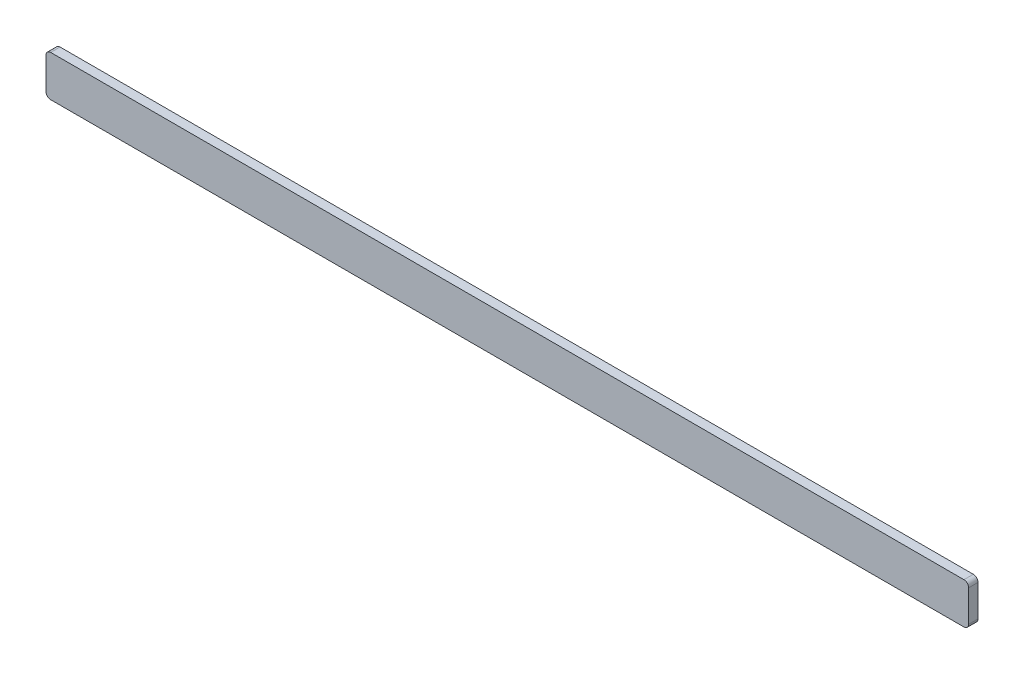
ISO-10303-21;
HEADER;
FILE_DESCRIPTION(('STEP AP214'),'2;1');
FILE_NAME('part.step','',(''),(''),'','','');
FILE_SCHEMA(('AUTOMOTIVE_DESIGN { 1 0 10303 214 1 1 1 1 }'));
ENDSEC;
DATA;
#1=APPLICATION_CONTEXT('core data for automotive mechanical design processes');
#2=APPLICATION_PROTOCOL_DEFINITION('international standard','automotive_design',2000,#1);
#3=PRODUCT_CONTEXT('',#1,'mechanical');
#4=PRODUCT('Part','Part','',(#3));
#5=PRODUCT_RELATED_PRODUCT_CATEGORY('part','',(#4));
#6=PRODUCT_DEFINITION_FORMATION('','',#4);
#7=PRODUCT_DEFINITION_CONTEXT('part definition',#1,'design');
#8=PRODUCT_DEFINITION('design','',#6,#7);
#9=PRODUCT_DEFINITION_SHAPE('','',#8);
#10=(LENGTH_UNIT() NAMED_UNIT(*) SI_UNIT(.MILLI.,.METRE.));
#11=(NAMED_UNIT(*) PLANE_ANGLE_UNIT() SI_UNIT($,.RADIAN.));
#12=(NAMED_UNIT(*) SI_UNIT($,.STERADIAN.) SOLID_ANGLE_UNIT());
#13=UNCERTAINTY_MEASURE_WITH_UNIT(LENGTH_MEASURE(1.E-05),#10,'distance_accuracy_value','');
#14=(GEOMETRIC_REPRESENTATION_CONTEXT(3) GLOBAL_UNCERTAINTY_ASSIGNED_CONTEXT((#13)) GLOBAL_UNIT_ASSIGNED_CONTEXT((#10,
#11,#12)) REPRESENTATION_CONTEXT('',''));
#15=CARTESIAN_POINT('',(0.,0.,0.));
#16=DIRECTION('',(0.,0.,1.));
#17=DIRECTION('',(1.,0.,0.));
#18=AXIS2_PLACEMENT_3D('',#15,#16,#17);
#19=CARTESIAN_POINT('',(195.000095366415,-150.421392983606,263.128080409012));
#20=DIRECTION('',(-3.16923956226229E-08,3.73783141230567E-09,1.));
#21=DIRECTION('',(-0.999999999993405,3.63158778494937E-06,-3.16924091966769E-08));
#22=AXIS2_PLACEMENT_3D('',#19,#20,#21);
#23=CYLINDRICAL_SURFACE('',#22,2.);
#24=CARTESIAN_POINT('',(195.00009530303,-150.42139297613,265.128080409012));
#25=DIRECTION('',(3.16923956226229E-08,-3.73783141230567E-09,-1.));
#26=DIRECTION('',(0.999999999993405,-3.63158778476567E-06,3.16924091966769E-08));
#27=AXIS2_PLACEMENT_3D('',#24,#25,#26);
#28=CIRCLE('',#27,2.);
#29=CARTESIAN_POINT('',(195.000102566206,-148.421392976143,265.128080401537));
#30=VERTEX_POINT('',#29);
#31=CARTESIAN_POINT('',(197.000095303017,-150.421400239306,265.128080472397));
#32=VERTEX_POINT('',#31);
#33=EDGE_CURVE('E11',#30,#32,#28,.T.);
#34=ORIENTED_EDGE('',*,*,#33,.T.);
#35=DIRECTION('',(-3.16923956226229E-08,3.73783141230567E-09,1.));
#36=VECTOR('',#35,1.);
#37=CARTESIAN_POINT('',(197.000095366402,-150.421400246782,263.128080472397));
#38=LINE('',#37,#36);
#39=CARTESIAN_POINT('',(197.000095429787,-150.421400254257,261.128080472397));
#40=VERTEX_POINT('',#39);
#41=EDGE_CURVE('E37',#40,#32,#38,.T.);
#42=ORIENTED_EDGE('',*,*,#41,.F.);
#43=CARTESIAN_POINT('',(195.0000954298,-150.421392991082,261.128080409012));
#44=DIRECTION('',(-3.16923956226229E-08,3.73783141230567E-09,1.));
#45=DIRECTION('',(0.999999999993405,-3.63158778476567E-06,3.16924091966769E-08));
#46=AXIS2_PLACEMENT_3D('',#43,#44,#45);
#47=CIRCLE('',#46,2.);
#48=CARTESIAN_POINT('',(195.000102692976,-148.421392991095,261.128080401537));
#49=VERTEX_POINT('',#48);
#50=EDGE_CURVE('E28',#40,#49,#47,.T.);
#51=ORIENTED_EDGE('',*,*,#50,.T.);
#52=DIRECTION('',(-3.16923956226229E-08,3.73783141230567E-09,1.));
#53=VECTOR('',#52,1.);
#54=CARTESIAN_POINT('',(195.000102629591,-148.421392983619,263.128080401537));
#55=LINE('',#54,#53);
#56=EDGE_CURVE('E158',#49,#30,#55,.T.);
#57=ORIENTED_EDGE('',*,*,#56,.T.);
#58=EDGE_LOOP('',(#34,#42,#51,#57));
#59=FACE_BOUND('',#58,.T.);
#60=ADVANCED_FACE('F17',(#59),#23,.T.);
#61=CARTESIAN_POINT('',(197.000102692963,-148.42140025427,261.128080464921));
#62=DIRECTION('',(-0.999999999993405,3.63158778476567E-06,-3.16924091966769E-08));
#63=DIRECTION('',(3.63158778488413E-06,0.999999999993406,-3.73771631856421E-09));
#64=AXIS2_PLACEMENT_3D('',#61,#62,#63);
#65=PLANE('',#64);
#66=DIRECTION('',(-3.16923956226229E-08,3.73783141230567E-09,1.));
#67=VECTOR('',#66,1.);
#68=CARTESIAN_POINT('',(197.000046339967,-163.921400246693,263.128080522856));
#69=LINE('',#68,#67);
#70=CARTESIAN_POINT('',(197.000046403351,-163.921400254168,261.128080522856));
#71=VERTEX_POINT('',#70);
#72=CARTESIAN_POINT('',(197.000046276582,-163.921400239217,265.128080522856));
#73=VERTEX_POINT('',#72);
#74=EDGE_CURVE('E141',#71,#73,#69,.T.);
#75=ORIENTED_EDGE('',*,*,#74,.F.);
#76=DIRECTION('',(3.63158778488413E-06,0.999999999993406,-3.73771631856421E-09));
#77=VECTOR('',#76,1.);
#78=CARTESIAN_POINT('',(197.000070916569,-157.171400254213,261.128080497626));
#79=LINE('',#78,#77);
#80=EDGE_CURVE('E155',#71,#40,#79,.T.);
#81=ORIENTED_EDGE('',*,*,#80,.T.);
#82=ORIENTED_EDGE('',*,*,#41,.T.);
#83=DIRECTION('',(3.63158778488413E-06,0.999999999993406,-3.73771631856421E-09));
#84=VECTOR('',#83,1.);
#85=CARTESIAN_POINT('',(197.0000707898,-157.171400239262,265.128080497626));
#86=LINE('',#85,#84);
#87=EDGE_CURVE('E118',#73,#32,#86,.T.);
#88=ORIENTED_EDGE('',*,*,#87,.F.);
#89=EDGE_LOOP('',(#75,#81,#82,#88));
#90=FACE_BOUND('',#89,.T.);
#91=ADVANCED_FACE('F254',(#90),#65,.F.);
#92=CARTESIAN_POINT('',(195.00004633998,-163.921392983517,263.128080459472));
#93=DIRECTION('',(-3.16923956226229E-08,3.73783141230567E-09,1.));
#94=DIRECTION('',(3.63158778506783E-06,0.999999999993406,-3.73771631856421E-09));
#95=AXIS2_PLACEMENT_3D('',#92,#93,#94);
#96=CYLINDRICAL_SURFACE('',#95,2.);
#97=CARTESIAN_POINT('',(195.000046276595,-163.921392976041,265.128080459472));
#98=DIRECTION('',(3.16923956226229E-08,-3.73783141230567E-09,-1.));
#99=DIRECTION('',(0.999999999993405,-3.63158778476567E-06,3.16924091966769E-08));
#100=AXIS2_PLACEMENT_3D('',#97,#98,#99);
#101=CIRCLE('',#100,2.);
#102=CARTESIAN_POINT('',(195.000039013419,-165.921392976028,265.128080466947));
#103=VERTEX_POINT('',#102);
#104=EDGE_CURVE('E146',#73,#103,#101,.T.);
#105=ORIENTED_EDGE('',*,*,#104,.T.);
#106=DIRECTION('',(-3.16923956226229E-08,3.73783141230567E-09,1.));
#107=VECTOR('',#106,1.);
#108=CARTESIAN_POINT('',(195.000039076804,-165.921392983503,263.128080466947));
#109=LINE('',#108,#107);
#110=CARTESIAN_POINT('',(195.000039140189,-165.921392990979,261.128080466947));
#111=VERTEX_POINT('',#110);
#112=EDGE_CURVE('E100',#111,#103,#109,.T.);
#113=ORIENTED_EDGE('',*,*,#112,.F.);
#114=CARTESIAN_POINT('',(195.000046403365,-163.921392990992,261.128080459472));
#115=DIRECTION('',(-3.16923956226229E-08,3.73783141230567E-09,1.));
#116=DIRECTION('',(0.999999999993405,-3.63158778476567E-06,3.16924091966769E-08));
#117=AXIS2_PLACEMENT_3D('',#114,#115,#116);
#118=CIRCLE('',#117,2.);
#119=EDGE_CURVE('E142',#111,#71,#118,.T.);
#120=ORIENTED_EDGE('',*,*,#119,.T.);
#121=ORIENTED_EDGE('',*,*,#74,.T.);
#122=EDGE_LOOP('',(#105,#113,#120,#121));
#123=FACE_BOUND('',#122,.T.);
#124=ADVANCED_FACE('F245',(#123),#96,.T.);
#125=CARTESIAN_POINT('',(-196.999897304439,-148.419969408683,261.128067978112));
#126=DIRECTION('',(-3.63158778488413E-06,-0.999999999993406,3.73771631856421E-09));
#127=DIRECTION('',(-0.999999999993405,3.63158778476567E-06,-3.16924091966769E-08));
#128=AXIS2_PLACEMENT_3D('',#125,#126,#127);
#129=PLANE('',#128);
#130=DIRECTION('',(-3.16923956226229E-08,3.73783141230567E-09,1.));
#131=VECTOR('',#130,1.);
#132=CARTESIAN_POINT('',(-194.999897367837,-148.419976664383,263.128068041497));
#133=LINE('',#132,#131);
#134=CARTESIAN_POINT('',(-194.999897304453,-148.419976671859,261.128068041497));
#135=VERTEX_POINT('',#134);
#136=CARTESIAN_POINT('',(-194.999897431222,-148.419976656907,265.128068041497));
#137=VERTEX_POINT('',#136);
#138=EDGE_CURVE('E135',#135,#137,#133,.T.);
#139=ORIENTED_EDGE('',*,*,#138,.T.);
#140=DIRECTION('',(-0.999999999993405,3.63158778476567E-06,-3.16924091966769E-08));
#141=VECTOR('',#140,1.);
#142=CARTESIAN_POINT('',(0.000102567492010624,-148.420684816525,265.128074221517));
#143=LINE('',#142,#141);
#144=EDGE_CURVE('E92',#30,#137,#143,.T.);
#145=ORIENTED_EDGE('',*,*,#144,.F.);
#146=ORIENTED_EDGE('',*,*,#56,.F.);
#147=DIRECTION('',(-0.999999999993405,3.63158778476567E-06,-3.16924091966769E-08));
#148=VECTOR('',#147,1.);
#149=CARTESIAN_POINT('',(0.000102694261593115,-148.420684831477,261.128074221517));
#150=LINE('',#149,#148);
#151=EDGE_CURVE('E132',#49,#135,#150,.T.);
#152=ORIENTED_EDGE('',*,*,#151,.T.);
#153=EDGE_LOOP('',(#139,#145,#146,#152));
#154=FACE_BOUND('',#153,.T.);
#155=ADVANCED_FACE('F236',(#154),#129,.F.);
#156=CARTESIAN_POINT('',(-194.999904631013,-150.41997666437,263.128068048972));
#157=DIRECTION('',(-3.16923956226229E-08,3.73783141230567E-09,1.));
#158=DIRECTION('',(-3.63158778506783E-06,-0.999999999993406,3.73771631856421E-09));
#159=AXIS2_PLACEMENT_3D('',#156,#157,#158);
#160=CYLINDRICAL_SURFACE('',#159,2.);
#161=CARTESIAN_POINT('',(-194.999904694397,-150.419976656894,265.128068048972));
#162=DIRECTION('',(3.16923956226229E-08,-3.73783141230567E-09,-1.));
#163=DIRECTION('',(0.999999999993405,-3.63158778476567E-06,3.16924091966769E-08));
#164=AXIS2_PLACEMENT_3D('',#161,#162,#163);
#165=CIRCLE('',#164,2.);
#166=CARTESIAN_POINT('',(-196.999904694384,-150.419969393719,265.128067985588));
#167=VERTEX_POINT('',#166);
#168=EDGE_CURVE('E90',#167,#137,#165,.T.);
#169=ORIENTED_EDGE('',*,*,#168,.T.);
#170=ORIENTED_EDGE('',*,*,#138,.F.);
#171=CARTESIAN_POINT('',(-194.999904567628,-150.419976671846,261.128068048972));
#172=DIRECTION('',(-3.16923956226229E-08,3.73783141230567E-09,1.));
#173=DIRECTION('',(0.999999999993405,-3.63158778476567E-06,3.16924091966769E-08));
#174=AXIS2_PLACEMENT_3D('',#171,#172,#173);
#175=CIRCLE('',#174,2.);
#176=CARTESIAN_POINT('',(-196.999904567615,-150.41996940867,261.128067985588));
#177=VERTEX_POINT('',#176);
#178=EDGE_CURVE('E126',#135,#177,#175,.T.);
#179=ORIENTED_EDGE('',*,*,#178,.T.);
#180=DIRECTION('',(-3.16923956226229E-08,3.73783141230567E-09,1.));
#181=VECTOR('',#180,1.);
#182=CARTESIAN_POINT('',(-196.999904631,-150.419969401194,263.128067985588));
#183=LINE('',#182,#181);
#184=EDGE_CURVE('E122',#177,#167,#183,.T.);
#185=ORIENTED_EDGE('',*,*,#184,.T.);
#186=EDGE_LOOP('',(#169,#170,#179,#185));
#187=FACE_BOUND('',#186,.T.);
#188=ADVANCED_FACE('F227',(#187),#160,.T.);
#189=CARTESIAN_POINT('',(197.000039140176,-165.921400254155,261.128080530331));
#190=DIRECTION('',(3.63158778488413E-06,0.999999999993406,-3.73771631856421E-09));
#191=DIRECTION('',(0.999999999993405,-3.63158778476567E-06,3.16924091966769E-08));
#192=AXIS2_PLACEMENT_3D('',#189,#190,#191);
#193=PLANE('',#192);
#194=DIRECTION('',(-3.16923956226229E-08,3.73783141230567E-09,1.));
#195=VECTOR('',#194,1.);
#196=CARTESIAN_POINT('',(-194.999960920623,-165.919976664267,263.128068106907));
#197=LINE('',#196,#195);
#198=CARTESIAN_POINT('',(-194.999960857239,-165.919976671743,261.128068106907));
#199=VERTEX_POINT('',#198);
#200=CARTESIAN_POINT('',(-194.999960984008,-165.919976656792,265.128068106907));
#201=VERTEX_POINT('',#200);
#202=EDGE_CURVE('E102',#199,#201,#197,.T.);
#203=ORIENTED_EDGE('',*,*,#202,.F.);
#204=DIRECTION('',(0.999999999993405,-3.63158778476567E-06,3.16924091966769E-08));
#205=VECTOR('',#204,1.);
#206=CARTESIAN_POINT('',(3.91414753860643E-05,-165.920684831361,261.128074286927));
#207=LINE('',#206,#205);
#208=EDGE_CURVE('E119',#199,#111,#207,.T.);
#209=ORIENTED_EDGE('',*,*,#208,.T.);
#210=ORIENTED_EDGE('',*,*,#112,.T.);
#211=DIRECTION('',(0.999999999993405,-3.63158778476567E-06,3.16924091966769E-08));
#212=VECTOR('',#211,1.);
#213=CARTESIAN_POINT('',(3.90147058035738E-05,-165.92068481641,265.128074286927));
#214=LINE('',#213,#212);
#215=EDGE_CURVE('E114',#201,#103,#214,.T.);
#216=ORIENTED_EDGE('',*,*,#215,.F.);
#217=EDGE_LOOP('',(#203,#209,#210,#216));
#218=FACE_BOUND('',#217,.T.);
#219=ADVANCED_FACE('F219',(#218),#193,.F.);
#220=CARTESIAN_POINT('',(-196.999960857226,-165.919969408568,261.128068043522));
#221=DIRECTION('',(0.999999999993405,-3.63158778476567E-06,3.16924091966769E-08));
#222=DIRECTION('',(-3.63158778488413E-06,-0.999999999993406,3.73771631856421E-09));
#223=AXIS2_PLACEMENT_3D('',#220,#221,#222);
#224=PLANE('',#223);
#225=DIRECTION('',(-3.16923956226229E-08,3.73783141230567E-09,1.));
#226=VECTOR('',#225,1.);
#227=CARTESIAN_POINT('',(-196.999953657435,-163.919969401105,263.128068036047));
#228=LINE('',#227,#226);
#229=CARTESIAN_POINT('',(-196.99995359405,-163.919969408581,261.128068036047));
#230=VERTEX_POINT('',#229);
#231=CARTESIAN_POINT('',(-196.99995372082,-163.919969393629,265.128068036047));
#232=VERTEX_POINT('',#231);
#233=EDGE_CURVE('E94',#230,#232,#228,.T.);
#234=ORIENTED_EDGE('',*,*,#233,.T.);
#235=DIRECTION('',(-3.63158778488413E-06,-0.999999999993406,3.73771631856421E-09));
#236=VECTOR('',#235,1.);
#237=CARTESIAN_POINT('',(-196.999929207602,-157.169969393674,265.128068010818));
#238=LINE('',#237,#236);
#239=EDGE_CURVE('E85',#167,#232,#238,.T.);
#240=ORIENTED_EDGE('',*,*,#239,.F.);
#241=ORIENTED_EDGE('',*,*,#184,.F.);
#242=DIRECTION('',(-3.63158778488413E-06,-0.999999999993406,3.73771631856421E-09));
#243=VECTOR('',#242,1.);
#244=CARTESIAN_POINT('',(-196.999929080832,-157.169969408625,261.128068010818));
#245=LINE('',#244,#243);
#246=EDGE_CURVE('E78',#177,#230,#245,.T.);
#247=ORIENTED_EDGE('',*,*,#246,.T.);
#248=EDGE_LOOP('',(#234,#240,#241,#247));
#249=FACE_BOUND('',#248,.T.);
#250=ADVANCED_FACE('F95',(#249),#224,.F.);
#251=CARTESIAN_POINT('',(7.09178684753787E-05,-157.170684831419,261.128074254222));
#252=DIRECTION('',(-3.16923956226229E-08,3.73783141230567E-09,1.));
#253=DIRECTION('',(0.999999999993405,-3.63158778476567E-06,3.16924091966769E-08));
#254=AXIS2_PLACEMENT_3D('',#251,#252,#253);
#255=PLANE('',#254);
#256=CARTESIAN_POINT('',(-194.999953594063,-163.919976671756,261.128068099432));
#257=DIRECTION('',(-3.16923956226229E-08,3.73783141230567E-09,1.));
#258=DIRECTION('',(0.999999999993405,-3.63158778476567E-06,3.16924091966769E-08));
#259=AXIS2_PLACEMENT_3D('',#256,#257,#258);
#260=CIRCLE('',#259,2.);
#261=EDGE_CURVE('E105',#230,#199,#260,.T.);
#262=ORIENTED_EDGE('',*,*,#261,.F.);
#263=ORIENTED_EDGE('',*,*,#246,.F.);
#264=ORIENTED_EDGE('',*,*,#178,.F.);
#265=ORIENTED_EDGE('',*,*,#151,.F.);
#266=ORIENTED_EDGE('',*,*,#50,.F.);
#267=ORIENTED_EDGE('',*,*,#80,.F.);
#268=ORIENTED_EDGE('',*,*,#119,.F.);
#269=ORIENTED_EDGE('',*,*,#208,.F.);
#270=EDGE_LOOP('',(#262,#263,#264,#265,#266,#267,#268,#269));
#271=FACE_BOUND('',#270,.T.);
#272=ADVANCED_FACE('F204',(#271),#255,.F.);
#273=CARTESIAN_POINT('',(7.07910988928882E-05,-157.170684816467,265.128074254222));
#274=DIRECTION('',(-3.16923956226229E-08,3.73783141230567E-09,1.));
#275=DIRECTION('',(0.999999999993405,-3.63158778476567E-06,3.16924091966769E-08));
#276=AXIS2_PLACEMENT_3D('',#273,#274,#275);
#277=PLANE('',#276);
#278=ORIENTED_EDGE('',*,*,#215,.T.);
#279=ORIENTED_EDGE('',*,*,#104,.F.);
#280=ORIENTED_EDGE('',*,*,#87,.T.);
#281=ORIENTED_EDGE('',*,*,#33,.F.);
#282=ORIENTED_EDGE('',*,*,#144,.T.);
#283=ORIENTED_EDGE('',*,*,#168,.F.);
#284=ORIENTED_EDGE('',*,*,#239,.T.);
#285=CARTESIAN_POINT('',(-194.999953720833,-163.919976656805,265.128068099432));
#286=DIRECTION('',(3.16923956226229E-08,-3.73783141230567E-09,-1.));
#287=DIRECTION('',(0.999999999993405,-3.63158778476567E-06,3.16924091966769E-08));
#288=AXIS2_PLACEMENT_3D('',#285,#286,#287);
#289=CIRCLE('',#288,2.);
#290=EDGE_CURVE('E21',#201,#232,#289,.T.);
#291=ORIENTED_EDGE('',*,*,#290,.F.);
#292=EDGE_LOOP('',(#278,#279,#280,#281,#282,#283,#284,#291));
#293=FACE_BOUND('',#292,.T.);
#294=ADVANCED_FACE('F87',(#293),#277,.T.);
#295=CARTESIAN_POINT('',(-194.999953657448,-163.919976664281,263.128068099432));
#296=DIRECTION('',(-3.16923956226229E-08,3.73783141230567E-09,1.));
#297=DIRECTION('',(0.999999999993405,-3.63158778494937E-06,3.16924091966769E-08));
#298=AXIS2_PLACEMENT_3D('',#295,#296,#297);
#299=CYLINDRICAL_SURFACE('',#298,2.);
#300=ORIENTED_EDGE('',*,*,#290,.T.);
#301=ORIENTED_EDGE('',*,*,#233,.F.);
#302=ORIENTED_EDGE('',*,*,#261,.T.);
#303=ORIENTED_EDGE('',*,*,#202,.T.);
#304=EDGE_LOOP('',(#300,#301,#302,#303));
#305=FACE_BOUND('',#304,.T.);
#306=ADVANCED_FACE('F19',(#305),#299,.T.);
#307=CLOSED_SHELL('',(#60,#91,#124,#155,#188,#219,#250,#272,#294,#306));
#308=MANIFOLD_SOLID_BREP('B1',#307);
#309=ADVANCED_BREP_SHAPE_REPRESENTATION('',(#18,#308),#14);
#310=SHAPE_DEFINITION_REPRESENTATION(#9,#309);
ENDSEC;
END-ISO-10303-21;
